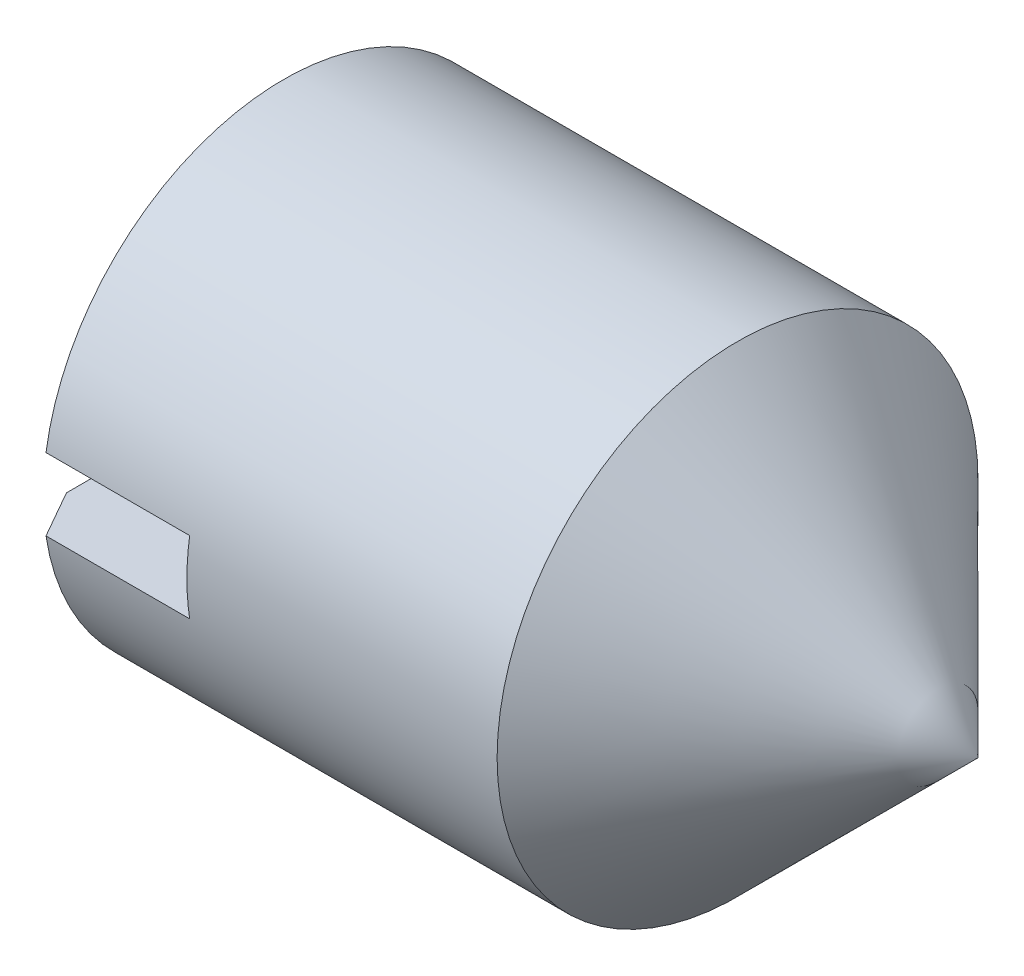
ISO-10303-21;
HEADER;
FILE_DESCRIPTION(('STEP AP214'),'2;1');
FILE_NAME('part.step','',(''),(''),'','','');
FILE_SCHEMA(('AUTOMOTIVE_DESIGN { 1 0 10303 214 1 1 1 1 }'));
ENDSEC;
DATA;
#1=APPLICATION_CONTEXT('core data for automotive mechanical design processes');
#2=APPLICATION_PROTOCOL_DEFINITION('international standard','automotive_design',2000,#1);
#3=PRODUCT_CONTEXT('',#1,'mechanical');
#4=PRODUCT('Part','Part','',(#3));
#5=PRODUCT_RELATED_PRODUCT_CATEGORY('part','',(#4));
#6=PRODUCT_DEFINITION_FORMATION('','',#4);
#7=PRODUCT_DEFINITION_CONTEXT('part definition',#1,'design');
#8=PRODUCT_DEFINITION('design','',#6,#7);
#9=PRODUCT_DEFINITION_SHAPE('','',#8);
#10=(LENGTH_UNIT() NAMED_UNIT(*) SI_UNIT(.MILLI.,.METRE.));
#11=(NAMED_UNIT(*) PLANE_ANGLE_UNIT() SI_UNIT($,.RADIAN.));
#12=(NAMED_UNIT(*) SI_UNIT($,.STERADIAN.) SOLID_ANGLE_UNIT());
#13=UNCERTAINTY_MEASURE_WITH_UNIT(LENGTH_MEASURE(1.E-05),#10,'distance_accuracy_value','');
#14=(GEOMETRIC_REPRESENTATION_CONTEXT(3) GLOBAL_UNCERTAINTY_ASSIGNED_CONTEXT((#13)) GLOBAL_UNIT_ASSIGNED_CONTEXT((#10,
#11,#12)) REPRESENTATION_CONTEXT('',''));
#15=CARTESIAN_POINT('',(0.,0.,0.));
#16=DIRECTION('',(0.,0.,1.));
#17=DIRECTION('',(1.,0.,0.));
#18=AXIS2_PLACEMENT_3D('',#15,#16,#17);
#19=CARTESIAN_POINT('',(0.,0.,0.));
#20=DIRECTION('',(-1.,0.,0.));
#21=DIRECTION('',(0.,0.,1.));
#22=AXIS2_PLACEMENT_3D('',#19,#20,#21);
#23=PLANE('',#22);
#24=CARTESIAN_POINT('',(0.,0.,0.));
#25=DIRECTION('',(-1.,0.,0.));
#26=DIRECTION('',(0.,0.,1.));
#27=AXIS2_PLACEMENT_3D('',#24,#25,#26);
#28=CIRCLE('',#27,1.61);
#29=CARTESIAN_POINT('',(0.,-0.3,-1.58180276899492));
#30=VERTEX_POINT('',#29);
#31=CARTESIAN_POINT('',(0.,-0.3,1.58180276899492));
#32=VERTEX_POINT('',#31);
#33=EDGE_CURVE('E156',#30,#32,#28,.T.);
#34=ORIENTED_EDGE('',*,*,#33,.T.);
#35=DIRECTION('',(0.,0.,-1.));
#36=VECTOR('',#35,1.);
#37=CARTESIAN_POINT('',(0.,-0.3,2.));
#38=LINE('',#37,#36);
#39=EDGE_CURVE('E112',#32,#30,#38,.T.);
#40=ORIENTED_EDGE('',*,*,#39,.T.);
#41=EDGE_LOOP('',(#34,#40));
#42=FACE_BOUND('',#41,.T.);
#43=ADVANCED_FACE('F33',(#42),#23,.T.);
#44=CARTESIAN_POINT('',(0.,0.,0.));
#45=DIRECTION('',(1.,0.,0.));
#46=DIRECTION('',(0.,0.,-1.));
#47=AXIS2_PLACEMENT_3D('',#44,#45,#46);
#48=CONICAL_SURFACE('',#47,1.61,1.0471975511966);
#49=CARTESIAN_POINT('',(0.225166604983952,0.,0.));
#50=DIRECTION('',(-1.,0.,0.));
#51=DIRECTION('',(0.,0.,1.));
#52=AXIS2_PLACEMENT_3D('',#49,#50,#51);
#53=CIRCLE('',#52,2.);
#54=CARTESIAN_POINT('',(0.225166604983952,-0.3,-1.97737199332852));
#55=VERTEX_POINT('',#54);
#56=CARTESIAN_POINT('',(0.225166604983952,-0.3,1.97737199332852));
#57=VERTEX_POINT('',#56);
#58=EDGE_CURVE('E161',#55,#57,#53,.T.);
#59=ORIENTED_EDGE('',*,*,#58,.T.);
#60=CARTESIAN_POINT('',(1.61900888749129,-0.299999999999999,4.4039994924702));
#61=CARTESIAN_POINT('',(1.51181694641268,-0.299999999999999,4.21790050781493));
#62=CARTESIAN_POINT('',(1.4046429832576,-0.299999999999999,4.03179115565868));
#63=CARTESIAN_POINT('',(1.19036671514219,-0.299999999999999,3.65952998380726));
#64=CARTESIAN_POINT('',(1.08326441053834,-0.3,3.47337816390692));
#65=CARTESIAN_POINT('',(0.86918337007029,-0.3,3.10103850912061));
#66=CARTESIAN_POINT('',(0.762204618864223,-0.3,2.91485068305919));
#67=CARTESIAN_POINT('',(0.548439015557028,-0.3,2.54236591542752));
#68=CARTESIAN_POINT('',(0.441652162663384,-0.3,2.35606897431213));
#69=CARTESIAN_POINT('',(0.229269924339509,-0.3,1.98473128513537));
#70=CARTESIAN_POINT('',(0.123671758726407,-0.3,1.79969212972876));
#71=CARTESIAN_POINT('',(-0.0340898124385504,-0.3,1.52175521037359));
#72=CARTESIAN_POINT('',(-0.0865745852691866,-0.3,1.42904025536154));
#73=CARTESIAN_POINT('',(-0.191153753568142,-0.3,1.24339386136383));
#74=CARTESIAN_POINT('',(-0.243248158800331,-0.3,1.15046242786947));
#75=CARTESIAN_POINT('',(-0.346871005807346,-0.3,0.963938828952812));
#76=CARTESIAN_POINT('',(-0.398397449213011,-0.3,0.870345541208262));
#77=CARTESIAN_POINT('',(-0.474367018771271,-0.3,0.72924876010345));
#78=CARTESIAN_POINT('',(-0.499469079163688,-0.3,0.682100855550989));
#79=CARTESIAN_POINT('',(-0.548908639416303,-0.3,0.587409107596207));
#80=CARTESIAN_POINT('',(-0.573246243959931,-0.3,0.539865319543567));
#81=CARTESIAN_POINT('',(-0.608769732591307,-0.3,0.467785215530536));
#82=CARTESIAN_POINT('',(-0.620498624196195,-0.3,0.443517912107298));
#83=CARTESIAN_POINT('',(-0.643407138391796,-0.3,0.394726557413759));
#84=CARTESIAN_POINT('',(-0.654586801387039,-0.3,0.370202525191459));
#85=CARTESIAN_POINT('',(-0.676156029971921,-0.3,0.320725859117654));
#86=CARTESIAN_POINT('',(-0.686543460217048,-0.3,0.295772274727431));
#87=CARTESIAN_POINT('',(-0.70603245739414,-0.3,0.245378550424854));
#88=CARTESIAN_POINT('',(-0.715134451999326,-0.3,0.219938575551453));
#89=CARTESIAN_POINT('',(-0.733754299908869,-0.3,0.160563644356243));
#90=CARTESIAN_POINT('',(-0.742567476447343,-0.3,0.12638360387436));
#91=CARTESIAN_POINT('',(-0.751318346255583,-0.3,0.0745063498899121));
#92=CARTESIAN_POINT('',(-0.753490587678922,-0.3,0.0571943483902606));
#93=CARTESIAN_POINT('',(-0.756129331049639,-0.3,0.0224398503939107));
#94=CARTESIAN_POINT('',(-0.756596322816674,-0.3,0.00499739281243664));
#95=CARTESIAN_POINT('',(-0.755763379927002,-0.3,-0.0298902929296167));
#96=CARTESIAN_POINT('',(-0.754458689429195,-0.3,-0.0473354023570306));
#97=CARTESIAN_POINT('',(-0.750238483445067,-0.3,-0.0820313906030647));
#98=CARTESIAN_POINT('',(-0.747322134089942,-0.3,-0.0992821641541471));
#99=CARTESIAN_POINT('',(-0.740137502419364,-0.3,-0.133694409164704));
#100=CARTESIAN_POINT('',(-0.73585438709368,-0.3,-0.15085269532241));
#101=CARTESIAN_POINT('',(-0.726261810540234,-0.3,-0.184873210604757));
#102=CARTESIAN_POINT('',(-0.720952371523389,-0.3,-0.201735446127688));
#103=CARTESIAN_POINT('',(-0.702912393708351,-0.3,-0.254848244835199));
#104=CARTESIAN_POINT('',(-0.688787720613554,-0.3,-0.290618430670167));
#105=CARTESIAN_POINT('',(-0.65870973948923,-0.3,-0.361388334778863));
#106=CARTESIAN_POINT('',(-0.642754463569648,-0.3,-0.396387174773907));
#107=CARTESIAN_POINT('',(-0.609773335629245,-0.3,-0.46597733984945));
#108=CARTESIAN_POINT('',(-0.59274502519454,-0.3,-0.500567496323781));
#109=CARTESIAN_POINT('',(-0.558061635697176,-0.3,-0.569433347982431));
#110=CARTESIAN_POINT('',(-0.540406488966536,-0.3,-0.603709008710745));
#111=CARTESIAN_POINT('',(-0.486743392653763,-0.3,-0.706440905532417));
#112=CARTESIAN_POINT('',(-0.450143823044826,-0.3,-0.774587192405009));
#113=CARTESIAN_POINT('',(-0.376279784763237,-0.3,-0.910364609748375));
#114=CARTESIAN_POINT('',(-0.339016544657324,-0.3,-0.977996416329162));
#115=CARTESIAN_POINT('',(-0.261873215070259,-0.3,-1.11700666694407));
#116=CARTESIAN_POINT('',(-0.221968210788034,-0.3,-1.18837129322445));
#117=CARTESIAN_POINT('',(-0.141888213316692,-0.3,-1.33094841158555));
#118=CARTESIAN_POINT('',(-0.101713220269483,-0.3,-1.4021609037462));
#119=CARTESIAN_POINT('',(0.019066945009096,-0.3,-1.61565940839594));
#120=CARTESIAN_POINT('',(0.0999249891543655,-0.3,-1.75780231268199));
#121=CARTESIAN_POINT('',(0.262019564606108,-0.3,-2.04202511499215));
#122=CARTESIAN_POINT('',(0.343256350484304,-0.3,-2.18410486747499));
#123=CARTESIAN_POINT('',(0.505908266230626,-0.3,-2.46816012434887));
#124=CARTESIAN_POINT('',(0.587323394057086,-0.3,-2.61013562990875));
#125=CARTESIAN_POINT('',(0.747879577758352,-0.3,-2.88987336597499));
#126=CARTESIAN_POINT('',(0.827017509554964,-0.3,-3.02763739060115));
#127=CARTESIAN_POINT('',(0.985361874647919,-0.3,-3.30312676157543));
#128=CARTESIAN_POINT('',(1.06456830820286,-0.3,-3.44085210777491));
#129=CARTESIAN_POINT('',(1.22296125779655,-0.3,-3.71615919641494));
#130=CARTESIAN_POINT('',(1.3021477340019,-0.3,-3.85374096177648));
#131=CARTESIAN_POINT('',(1.46055529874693,-0.3,-4.12888384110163));
#132=CARTESIAN_POINT('',(1.53977638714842,-0.300000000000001,-4.2664449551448));
#133=CARTESIAN_POINT('',(1.61900888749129,-0.300000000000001,-4.4039994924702));
#134=B_SPLINE_CURVE_WITH_KNOTS('',3,(#60,#61,#62,#63,#64,#65,#66,#67,#68,#69,#70,#71,#72,#73,
#74,#75,#76,#77,#78,#79,#80,#81,#82,#83,#84,#85,#86,#87,#88,#89,#90,#91,#92,#93,#94,#95,#96,#97,
#98,#99,#100,#101,#102,#103,#104,#105,#106,#107,#108,#109,#110,#111,#112,#113,#114,#115,#116,
#117,#118,#119,#120,#121,#122,#123,#124,#125,#126,#127,#128,#129,#130,#131,#132,#133),
.UNSPECIFIED.,.F.,.F.,(4,2,2,2,2,2,2,2,2,2,2,2,2,2,2,2,2,2,2,2,2,2,2,2,2,2,2,2,2,2,2,2,2,2,2,2,
4),(0.,0.644287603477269,1.28857838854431,1.93277799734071,2.57697493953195,3.21612511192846,
3.53574344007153,3.85535374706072,4.17586091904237,4.33609990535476,4.49631685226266,
4.57717121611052,4.658019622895,4.73907876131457,4.82011086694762,4.92561670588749,
4.97788731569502,5.03014290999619,5.08253905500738,5.13496233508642,5.18797508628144,
5.24098669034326,5.35623774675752,5.4716138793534,5.58726470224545,5.70292804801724,
5.93497334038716,6.16662637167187,6.41191639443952,6.65720628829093,7.14780029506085,
7.63879376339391,8.12978163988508,8.60641109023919,9.08304234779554,9.55927039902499,
10.0354965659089),.UNSPECIFIED.);
#135=EDGE_CURVE('E103',#57,#32,#134,.T.);
#136=ORIENTED_EDGE('',*,*,#135,.T.);
#137=ORIENTED_EDGE('',*,*,#33,.F.);
#138=EDGE_CURVE('E166',#30,#55,#134,.T.);
#139=ORIENTED_EDGE('',*,*,#138,.T.);
#140=EDGE_LOOP('',(#59,#136,#137,#139));
#141=FACE_BOUND('',#140,.T.);
#142=ADVANCED_FACE('F141',(#141),#48,.T.);
#143=CARTESIAN_POINT('',(-12.7,0.,0.));
#144=DIRECTION('',(-1.,0.,0.));
#145=DIRECTION('',(0.,0.,1.));
#146=AXIS2_PLACEMENT_3D('',#143,#144,#145);
#147=CYLINDRICAL_SURFACE('',#146,2.);
#148=CARTESIAN_POINT('',(4.00000000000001,0.,0.));
#149=DIRECTION('',(-1.,0.,0.));
#150=DIRECTION('',(0.,0.,1.));
#151=AXIS2_PLACEMENT_3D('',#148,#149,#150);
#152=CIRCLE('',#151,2.);
#153=CARTESIAN_POINT('',(4.00000000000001,0.,2.));
#154=VERTEX_POINT('',#153);
#155=EDGE_CURVE('E165',#154,#154,#152,.T.);
#156=ORIENTED_EDGE('',*,*,#155,.T.);
#157=EDGE_LOOP('',(#156));
#158=FACE_BOUND('',#157,.T.);
#159=ORIENTED_EDGE('',*,*,#58,.F.);
#160=DIRECTION('',(-1.,0.,0.));
#161=VECTOR('',#160,1.);
#162=CARTESIAN_POINT('',(-12.7,-0.3,-1.97737199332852));
#163=LINE('',#162,#161);
#164=CARTESIAN_POINT('',(1.42,-0.3,-1.97737199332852));
#165=VERTEX_POINT('',#164);
#166=EDGE_CURVE('E12',#55,#165,#163,.F.);
#167=ORIENTED_EDGE('',*,*,#166,.T.);
#168=CARTESIAN_POINT('',(1.42,0.,0.));
#169=DIRECTION('',(-1.,0.,0.));
#170=DIRECTION('',(0.,0.,1.));
#171=AXIS2_PLACEMENT_3D('',#168,#169,#170);
#172=CIRCLE('',#171,2.);
#173=CARTESIAN_POINT('',(1.42,0.299999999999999,-1.97737199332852));
#174=VERTEX_POINT('',#173);
#175=EDGE_CURVE('E99',#165,#174,#172,.F.);
#176=ORIENTED_EDGE('',*,*,#175,.T.);
#177=DIRECTION('',(-1.,0.,0.));
#178=VECTOR('',#177,1.);
#179=CARTESIAN_POINT('',(-12.7,0.299999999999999,-1.97737199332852));
#180=LINE('',#179,#178);
#181=CARTESIAN_POINT('',(0.225166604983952,0.299999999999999,-1.97737199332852));
#182=VERTEX_POINT('',#181);
#183=EDGE_CURVE('E41',#182,#174,#180,.F.);
#184=ORIENTED_EDGE('',*,*,#183,.F.);
#185=CARTESIAN_POINT('',(0.225166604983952,0.3,1.97737199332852));
#186=VERTEX_POINT('',#185);
#187=EDGE_CURVE('E157',#186,#182,#53,.T.);
#188=ORIENTED_EDGE('',*,*,#187,.F.);
#189=DIRECTION('',(-1.,0.,0.));
#190=VECTOR('',#189,1.);
#191=CARTESIAN_POINT('',(-12.7,0.3,1.97737199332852));
#192=LINE('',#191,#190);
#193=CARTESIAN_POINT('',(1.42,0.3,1.97737199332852));
#194=VERTEX_POINT('',#193);
#195=EDGE_CURVE('E92',#194,#186,#192,.T.);
#196=ORIENTED_EDGE('',*,*,#195,.F.);
#197=CARTESIAN_POINT('',(1.42,-0.3,1.97737199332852));
#198=VERTEX_POINT('',#197);
#199=EDGE_CURVE('E85',#194,#198,#172,.F.);
#200=ORIENTED_EDGE('',*,*,#199,.T.);
#201=DIRECTION('',(-1.,0.,0.));
#202=VECTOR('',#201,1.);
#203=CARTESIAN_POINT('',(-12.7,-0.3,1.97737199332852));
#204=LINE('',#203,#202);
#205=EDGE_CURVE('E89',#198,#57,#204,.T.);
#206=ORIENTED_EDGE('',*,*,#205,.T.);
#207=EDGE_LOOP('',(#159,#167,#176,#184,#188,#196,#200,#206));
#208=FACE_BOUND('',#207,.T.);
#209=ADVANCED_FACE('F88',(#158,#208),#147,.T.);
#210=DIRECTION('',(0.,0.,-1.));
#211=VECTOR('',#210,1.);
#212=CARTESIAN_POINT('',(0.,0.3,2.));
#213=LINE('',#212,#211);
#214=CARTESIAN_POINT('',(0.,0.3,1.58180276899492));
#215=VERTEX_POINT('',#214);
#216=CARTESIAN_POINT('',(0.,0.3,-1.58180276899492));
#217=VERTEX_POINT('',#216);
#218=EDGE_CURVE('E115',#215,#217,#213,.T.);
#219=ORIENTED_EDGE('',*,*,#218,.F.);
#220=EDGE_CURVE('E97',#215,#217,#28,.T.);
#221=ORIENTED_EDGE('',*,*,#220,.T.);
#222=EDGE_LOOP('',(#219,#221));
#223=FACE_BOUND('',#222,.T.);
#224=ADVANCED_FACE('F35',(#223),#23,.T.);
#225=CARTESIAN_POINT('',(1.61900888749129,0.3,4.4039994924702));
#226=CARTESIAN_POINT('',(1.51181694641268,0.3,4.21790050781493));
#227=CARTESIAN_POINT('',(1.4046429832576,0.3,4.03179115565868));
#228=CARTESIAN_POINT('',(1.19036671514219,0.3,3.65952998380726));
#229=CARTESIAN_POINT('',(1.08326441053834,0.3,3.47337816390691));
#230=CARTESIAN_POINT('',(0.869183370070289,0.3,3.1010385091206));
#231=CARTESIAN_POINT('',(0.762204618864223,0.3,2.91485068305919));
#232=CARTESIAN_POINT('',(0.548439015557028,0.3,2.54236591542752));
#233=CARTESIAN_POINT('',(0.441652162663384,0.3,2.35606897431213));
#234=CARTESIAN_POINT('',(0.229269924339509,0.3,1.98473128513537));
#235=CARTESIAN_POINT('',(0.123671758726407,0.3,1.79969212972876));
#236=CARTESIAN_POINT('',(-0.0340898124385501,0.3,1.52175521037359));
#237=CARTESIAN_POINT('',(-0.0865745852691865,0.3,1.42904025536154));
#238=CARTESIAN_POINT('',(-0.191153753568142,0.3,1.24339386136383));
#239=CARTESIAN_POINT('',(-0.243248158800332,0.3,1.15046242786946));
#240=CARTESIAN_POINT('',(-0.346871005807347,0.3,0.963938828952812));
#241=CARTESIAN_POINT('',(-0.398397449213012,0.3,0.870345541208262));
#242=CARTESIAN_POINT('',(-0.474367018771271,0.3,0.72924876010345));
#243=CARTESIAN_POINT('',(-0.499469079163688,0.3,0.682100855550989));
#244=CARTESIAN_POINT('',(-0.548908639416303,0.3,0.587409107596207));
#245=CARTESIAN_POINT('',(-0.573246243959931,0.3,0.539865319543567));
#246=CARTESIAN_POINT('',(-0.608769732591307,0.3,0.467785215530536));
#247=CARTESIAN_POINT('',(-0.620498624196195,0.3,0.443517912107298));
#248=CARTESIAN_POINT('',(-0.643407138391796,0.3,0.394726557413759));
#249=CARTESIAN_POINT('',(-0.654586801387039,0.3,0.370202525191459));
#250=CARTESIAN_POINT('',(-0.676156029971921,0.3,0.320725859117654));
#251=CARTESIAN_POINT('',(-0.686543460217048,0.3,0.295772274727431));
#252=CARTESIAN_POINT('',(-0.70603245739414,0.3,0.245378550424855));
#253=CARTESIAN_POINT('',(-0.715134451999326,0.3,0.219938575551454));
#254=CARTESIAN_POINT('',(-0.733754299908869,0.3,0.160563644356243));
#255=CARTESIAN_POINT('',(-0.742567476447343,0.3,0.126383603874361));
#256=CARTESIAN_POINT('',(-0.751318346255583,0.3,0.0745063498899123));
#257=CARTESIAN_POINT('',(-0.753490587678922,0.3,0.0571943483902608));
#258=CARTESIAN_POINT('',(-0.756129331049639,0.3,0.0224398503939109));
#259=CARTESIAN_POINT('',(-0.756596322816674,0.3,0.00499739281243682));
#260=CARTESIAN_POINT('',(-0.755763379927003,0.3,-0.0298902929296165));
#261=CARTESIAN_POINT('',(-0.754458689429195,0.3,-0.0473354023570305));
#262=CARTESIAN_POINT('',(-0.750238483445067,0.3,-0.0820313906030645));
#263=CARTESIAN_POINT('',(-0.747322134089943,0.3,-0.0992821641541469));
#264=CARTESIAN_POINT('',(-0.740137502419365,0.3,-0.133694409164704));
#265=CARTESIAN_POINT('',(-0.73585438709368,0.3,-0.15085269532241));
#266=CARTESIAN_POINT('',(-0.726261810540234,0.3,-0.184873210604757));
#267=CARTESIAN_POINT('',(-0.720952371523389,0.3,-0.201735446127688));
#268=CARTESIAN_POINT('',(-0.702912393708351,0.3,-0.254848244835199));
#269=CARTESIAN_POINT('',(-0.688787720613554,0.3,-0.290618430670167));
#270=CARTESIAN_POINT('',(-0.65870973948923,0.3,-0.361388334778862));
#271=CARTESIAN_POINT('',(-0.642754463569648,0.3,-0.396387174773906));
#272=CARTESIAN_POINT('',(-0.609773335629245,0.3,-0.465977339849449));
#273=CARTESIAN_POINT('',(-0.59274502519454,0.3,-0.500567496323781));
#274=CARTESIAN_POINT('',(-0.558061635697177,0.3,-0.56943334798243));
#275=CARTESIAN_POINT('',(-0.540406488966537,0.3,-0.603709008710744));
#276=CARTESIAN_POINT('',(-0.486743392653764,0.3,-0.706440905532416));
#277=CARTESIAN_POINT('',(-0.450143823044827,0.3,-0.774587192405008));
#278=CARTESIAN_POINT('',(-0.376279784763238,0.3,-0.910364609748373));
#279=CARTESIAN_POINT('',(-0.339016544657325,0.3,-0.97799641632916));
#280=CARTESIAN_POINT('',(-0.26187321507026,0.3,-1.11700666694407));
#281=CARTESIAN_POINT('',(-0.221968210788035,0.3,-1.18837129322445));
#282=CARTESIAN_POINT('',(-0.141888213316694,0.3,-1.33094841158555));
#283=CARTESIAN_POINT('',(-0.101713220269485,0.3,-1.4021609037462));
#284=CARTESIAN_POINT('',(0.0190669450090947,0.3,-1.61565940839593));
#285=CARTESIAN_POINT('',(0.0999249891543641,0.3,-1.75780231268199));
#286=CARTESIAN_POINT('',(0.262019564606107,0.299999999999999,-2.04202511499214));
#287=CARTESIAN_POINT('',(0.343256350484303,0.299999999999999,-2.18410486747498));
#288=CARTESIAN_POINT('',(0.505908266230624,0.299999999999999,-2.46816012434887));
#289=CARTESIAN_POINT('',(0.587323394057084,0.299999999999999,-2.61013562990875));
#290=CARTESIAN_POINT('',(0.74787957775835,0.299999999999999,-2.88987336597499));
#291=CARTESIAN_POINT('',(0.827017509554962,0.299999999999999,-3.02763739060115));
#292=CARTESIAN_POINT('',(0.985361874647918,0.299999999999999,-3.30312676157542));
#293=CARTESIAN_POINT('',(1.06456830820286,0.299999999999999,-3.44085210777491));
#294=CARTESIAN_POINT('',(1.22296125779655,0.299999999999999,-3.71615919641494));
#295=CARTESIAN_POINT('',(1.3021477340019,0.299999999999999,-3.85374096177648));
#296=CARTESIAN_POINT('',(1.46055529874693,0.299999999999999,-4.12888384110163));
#297=CARTESIAN_POINT('',(1.53977638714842,0.299999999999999,-4.2664449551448));
#298=CARTESIAN_POINT('',(1.61900888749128,0.299999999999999,-4.4039994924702));
#299=B_SPLINE_CURVE_WITH_KNOTS('',3,(#225,#226,#227,#228,#229,#230,#231,#232,#233,#234,#235,
#236,#237,#238,#239,#240,#241,#242,#243,#244,#245,#246,#247,#248,#249,#250,#251,#252,#253,#254,
#255,#256,#257,#258,#259,#260,#261,#262,#263,#264,#265,#266,#267,#268,#269,#270,#271,#272,#273,
#274,#275,#276,#277,#278,#279,#280,#281,#282,#283,#284,#285,#286,#287,#288,#289,#290,#291,#292,
#293,#294,#295,#296,#297,#298),.UNSPECIFIED.,.F.,.F.,(4,2,2,2,2,2,2,2,2,2,2,2,2,2,2,2,2,2,2,2,2,
2,2,2,2,2,2,2,2,2,2,2,2,2,2,2,4),(0.,0.64428760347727,1.28857838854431,1.93277799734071,
2.57697493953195,3.21612511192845,3.53574344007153,3.85535374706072,4.17586091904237,
4.33609990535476,4.49631685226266,4.57717121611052,4.658019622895,4.73907876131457,
4.82011086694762,4.92561670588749,4.97788731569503,5.03014290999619,5.08253905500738,
5.13496233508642,5.18797508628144,5.24098669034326,5.35623774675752,5.4716138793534,
5.58726470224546,5.70292804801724,5.93497334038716,6.16662637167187,6.41191639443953,
6.65720628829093,7.14780029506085,7.63879376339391,8.12978163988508,8.60641109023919,
9.08304234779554,9.55927039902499,10.0354965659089),.UNSPECIFIED.);
#300=EDGE_CURVE('E107',#186,#215,#299,.T.);
#301=ORIENTED_EDGE('',*,*,#300,.F.);
#302=ORIENTED_EDGE('',*,*,#187,.T.);
#303=EDGE_CURVE('E110',#217,#182,#299,.T.);
#304=ORIENTED_EDGE('',*,*,#303,.F.);
#305=ORIENTED_EDGE('',*,*,#220,.F.);
#306=EDGE_LOOP('',(#301,#302,#304,#305));
#307=FACE_BOUND('',#306,.T.);
#308=ADVANCED_FACE('F128',(#307),#48,.T.);
#309=CARTESIAN_POINT('',(4.00000000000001,0.,0.));
#310=DIRECTION('',(-1.,0.,0.));
#311=DIRECTION('',(0.,0.,1.));
#312=AXIS2_PLACEMENT_3D('',#309,#310,#311);
#313=CONICAL_SURFACE('',#312,2.,0.785398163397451);
#314=CARTESIAN_POINT('',(6.,0.,0.));
#315=VERTEX_POINT('',#314);
#316=VERTEX_LOOP('',#315);
#317=FACE_BOUND('',#316,.T.);
#318=ORIENTED_EDGE('',*,*,#155,.F.);
#319=EDGE_LOOP('',(#318));
#320=FACE_BOUND('',#319,.T.);
#321=ADVANCED_FACE('F138',(#317,#320),#313,.T.);
#322=CARTESIAN_POINT('',(1.42,-0.3,2.));
#323=DIRECTION('',(0.,1.,0.));
#324=DIRECTION('',(0.,0.,1.));
#325=AXIS2_PLACEMENT_3D('',#322,#323,#324);
#326=PLANE('',#325);
#327=ORIENTED_EDGE('',*,*,#39,.F.);
#328=ORIENTED_EDGE('',*,*,#135,.F.);
#329=ORIENTED_EDGE('',*,*,#205,.F.);
#330=DIRECTION('',(0.,0.,-1.));
#331=VECTOR('',#330,1.);
#332=CARTESIAN_POINT('',(1.42,-0.3,2.));
#333=LINE('',#332,#331);
#334=EDGE_CURVE('E101',#198,#165,#333,.T.);
#335=ORIENTED_EDGE('',*,*,#334,.T.);
#336=ORIENTED_EDGE('',*,*,#166,.F.);
#337=ORIENTED_EDGE('',*,*,#138,.F.);
#338=EDGE_LOOP('',(#327,#328,#329,#335,#336,#337));
#339=FACE_BOUND('',#338,.T.);
#340=ADVANCED_FACE('F100',(#339),#326,.T.);
#341=CARTESIAN_POINT('',(1.42,0.3,2.));
#342=DIRECTION('',(0.,1.,0.));
#343=DIRECTION('',(0.,0.,1.));
#344=AXIS2_PLACEMENT_3D('',#341,#342,#343);
#345=PLANE('',#344);
#346=ORIENTED_EDGE('',*,*,#303,.T.);
#347=ORIENTED_EDGE('',*,*,#183,.T.);
#348=DIRECTION('',(0.,0.,-1.));
#349=VECTOR('',#348,1.);
#350=CARTESIAN_POINT('',(1.42,0.3,2.));
#351=LINE('',#350,#349);
#352=EDGE_CURVE('E108',#194,#174,#351,.T.);
#353=ORIENTED_EDGE('',*,*,#352,.F.);
#354=ORIENTED_EDGE('',*,*,#195,.T.);
#355=ORIENTED_EDGE('',*,*,#300,.T.);
#356=ORIENTED_EDGE('',*,*,#218,.T.);
#357=EDGE_LOOP('',(#346,#347,#353,#354,#355,#356));
#358=FACE_BOUND('',#357,.T.);
#359=ADVANCED_FACE('F131',(#358),#345,.F.);
#360=CARTESIAN_POINT('',(1.42,-0.3,2.));
#361=DIRECTION('',(-1.,0.,0.));
#362=DIRECTION('',(0.,0.,1.));
#363=AXIS2_PLACEMENT_3D('',#360,#361,#362);
#364=PLANE('',#363);
#365=ORIENTED_EDGE('',*,*,#334,.F.);
#366=ORIENTED_EDGE('',*,*,#199,.F.);
#367=ORIENTED_EDGE('',*,*,#352,.T.);
#368=ORIENTED_EDGE('',*,*,#175,.F.);
#369=EDGE_LOOP('',(#365,#366,#367,#368));
#370=FACE_BOUND('',#369,.T.);
#371=ADVANCED_FACE('F105',(#370),#364,.T.);
#372=CLOSED_SHELL('',(#43,#142,#209,#224,#308,#321,#340,#359,#371));
#373=MANIFOLD_SOLID_BREP('B2',#372);
#374=ADVANCED_BREP_SHAPE_REPRESENTATION('',(#18,#373),#14);
#375=SHAPE_DEFINITION_REPRESENTATION(#9,#374);
ENDSEC;
END-ISO-10303-21;
